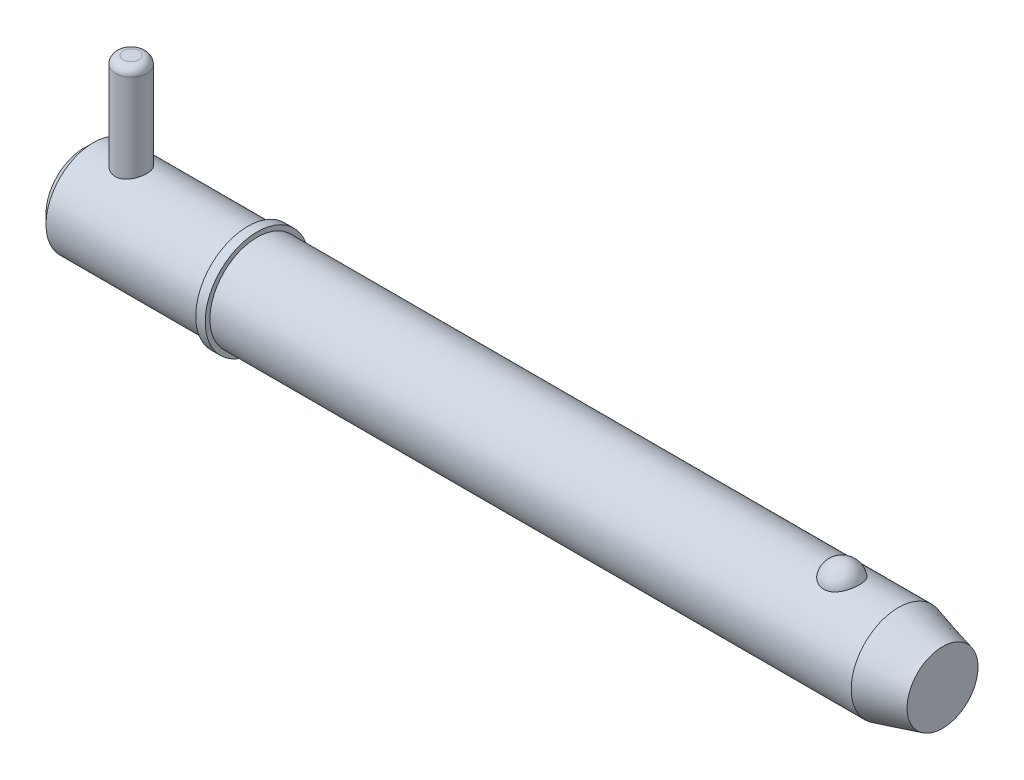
ISO-10303-21;
HEADER;
FILE_DESCRIPTION(('STEP AP214'),'2;1');
FILE_NAME('part.step','',(''),(''),'','','');
FILE_SCHEMA(('AUTOMOTIVE_DESIGN { 1 0 10303 214 1 1 1 1 }'));
ENDSEC;
DATA;
#1=APPLICATION_CONTEXT('core data for automotive mechanical design processes');
#2=APPLICATION_PROTOCOL_DEFINITION('international standard','automotive_design',2000,#1);
#3=PRODUCT_CONTEXT('',#1,'mechanical');
#4=PRODUCT('Part','Part','',(#3));
#5=PRODUCT_RELATED_PRODUCT_CATEGORY('part','',(#4));
#6=PRODUCT_DEFINITION_FORMATION('','',#4);
#7=PRODUCT_DEFINITION_CONTEXT('part definition',#1,'design');
#8=PRODUCT_DEFINITION('design','',#6,#7);
#9=PRODUCT_DEFINITION_SHAPE('','',#8);
#10=(LENGTH_UNIT() NAMED_UNIT(*) SI_UNIT(.MILLI.,.METRE.));
#11=(NAMED_UNIT(*) PLANE_ANGLE_UNIT() SI_UNIT($,.RADIAN.));
#12=(NAMED_UNIT(*) SI_UNIT($,.STERADIAN.) SOLID_ANGLE_UNIT());
#13=UNCERTAINTY_MEASURE_WITH_UNIT(LENGTH_MEASURE(1.E-05),#10,'distance_accuracy_value','');
#14=(GEOMETRIC_REPRESENTATION_CONTEXT(3) GLOBAL_UNCERTAINTY_ASSIGNED_CONTEXT((#13)) GLOBAL_UNIT_ASSIGNED_CONTEXT((#10,
#11,#12)) REPRESENTATION_CONTEXT('',''));
#15=CARTESIAN_POINT('',(0.,0.,0.));
#16=DIRECTION('',(0.,0.,1.));
#17=DIRECTION('',(1.,0.,0.));
#18=AXIS2_PLACEMENT_3D('',#15,#16,#17);
#19=CARTESIAN_POINT('',(9.52500000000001,28.575,0.));
#20=DIRECTION('',(0.,-1.,0.));
#21=DIRECTION('',(0.,0.,-1.));
#22=AXIS2_PLACEMENT_3D('',#19,#20,#21);
#23=CYLINDRICAL_SURFACE('',#22,3.175);
#24=CARTESIAN_POINT('',(9.52500000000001,-7.93750000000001,0.));
#25=DIRECTION('',(0.,1.,0.));
#26=DIRECTION('',(0.,0.,1.));
#27=AXIS2_PLACEMENT_3D('',#24,#25,#26);
#28=CIRCLE('',#27,3.175);
#29=CARTESIAN_POINT('',(9.52500000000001,-7.93750000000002,-3.175));
#30=VERTEX_POINT('',#29);
#31=EDGE_CURVE('P0_E25',#30,#30,#28,.T.);
#32=CARTESIAN_POINT('',(9.52500000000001,26.9875,0.));
#33=DIRECTION('',(0.,1.,0.));
#34=DIRECTION('',(0.,0.,1.));
#35=AXIS2_PLACEMENT_3D('',#32,#33,#34);
#36=CIRCLE('',#35,3.175);
#37=CARTESIAN_POINT('',(9.52500000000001,26.9875,-3.175));
#38=VERTEX_POINT('',#37);
#39=EDGE_CURVE('P0_E29',#38,#38,#36,.F.);
#40=CARTESIAN_POINT('',(9.52500000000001,-7.93750000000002,-3.175));
#41=CARTESIAN_POINT('',(9.52500000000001,-7.57369791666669,-3.175));
#42=CARTESIAN_POINT('',(9.52500000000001,-7.20989583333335,-3.175));
#43=CARTESIAN_POINT('',(9.52500000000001,-6.48229166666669,-3.175));
#44=CARTESIAN_POINT('',(9.52500000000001,-6.11848958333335,-3.175));
#45=CARTESIAN_POINT('',(9.52500000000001,-5.39088541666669,-3.175));
#46=CARTESIAN_POINT('',(9.52500000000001,-5.02708333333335,-3.175));
#47=CARTESIAN_POINT('',(9.52500000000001,-4.29947916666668,-3.175));
#48=CARTESIAN_POINT('',(9.52500000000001,-3.93567708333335,-3.175));
#49=CARTESIAN_POINT('',(9.52500000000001,-3.20807291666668,-3.175));
#50=CARTESIAN_POINT('',(9.52500000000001,-2.84427083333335,-3.175));
#51=CARTESIAN_POINT('',(9.52500000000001,-2.11666666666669,-3.175));
#52=CARTESIAN_POINT('',(9.52500000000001,-1.75286458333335,-3.175));
#53=CARTESIAN_POINT('',(9.52500000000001,-1.02526041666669,-3.175));
#54=CARTESIAN_POINT('',(9.52500000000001,-0.661458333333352,-3.175));
#55=CARTESIAN_POINT('',(9.52500000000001,0.0661458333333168,-3.175));
#56=CARTESIAN_POINT('',(9.52500000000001,0.429947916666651,-3.175));
#57=CARTESIAN_POINT('',(9.52500000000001,1.15755208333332,-3.175));
#58=CARTESIAN_POINT('',(9.52500000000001,1.52135416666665,-3.175));
#59=CARTESIAN_POINT('',(9.52500000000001,2.24895833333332,-3.175));
#60=CARTESIAN_POINT('',(9.52500000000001,2.61276041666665,-3.175));
#61=CARTESIAN_POINT('',(9.52500000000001,3.34036458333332,-3.175));
#62=CARTESIAN_POINT('',(9.52500000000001,3.70416666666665,-3.175));
#63=CARTESIAN_POINT('',(9.52500000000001,4.43177083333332,-3.175));
#64=CARTESIAN_POINT('',(9.52500000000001,4.79557291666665,-3.175));
#65=CARTESIAN_POINT('',(9.52500000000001,5.52317708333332,-3.175));
#66=CARTESIAN_POINT('',(9.52500000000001,5.88697916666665,-3.175));
#67=CARTESIAN_POINT('',(9.52500000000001,6.61458333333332,-3.175));
#68=CARTESIAN_POINT('',(9.52500000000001,6.97838541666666,-3.175));
#69=CARTESIAN_POINT('',(9.52500000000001,7.70598958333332,-3.175));
#70=CARTESIAN_POINT('',(9.52500000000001,8.06979166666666,-3.175));
#71=CARTESIAN_POINT('',(9.52500000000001,8.79739583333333,-3.175));
#72=CARTESIAN_POINT('',(9.52500000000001,9.16119791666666,-3.175));
#73=CARTESIAN_POINT('',(9.52500000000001,9.88880208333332,-3.175));
#74=CARTESIAN_POINT('',(9.52500000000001,10.2526041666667,-3.175));
#75=CARTESIAN_POINT('',(9.52500000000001,10.9802083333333,-3.175));
#76=CARTESIAN_POINT('',(9.52500000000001,11.3440104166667,-3.175));
#77=CARTESIAN_POINT('',(9.52500000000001,12.0716145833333,-3.175));
#78=CARTESIAN_POINT('',(9.52500000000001,12.4354166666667,-3.175));
#79=CARTESIAN_POINT('',(9.52500000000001,13.1630208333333,-3.175));
#80=CARTESIAN_POINT('',(9.52500000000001,13.5268229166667,-3.175));
#81=CARTESIAN_POINT('',(9.52500000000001,14.2544270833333,-3.175));
#82=CARTESIAN_POINT('',(9.52500000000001,14.6182291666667,-3.175));
#83=CARTESIAN_POINT('',(9.52500000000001,15.3458333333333,-3.175));
#84=CARTESIAN_POINT('',(9.52500000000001,15.7096354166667,-3.175));
#85=CARTESIAN_POINT('',(9.52500000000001,16.4372395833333,-3.175));
#86=CARTESIAN_POINT('',(9.52500000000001,16.8010416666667,-3.175));
#87=CARTESIAN_POINT('',(9.52500000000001,17.5286458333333,-3.175));
#88=CARTESIAN_POINT('',(9.52500000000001,17.8924479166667,-3.175));
#89=CARTESIAN_POINT('',(9.52500000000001,18.6200520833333,-3.175));
#90=CARTESIAN_POINT('',(9.52500000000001,18.9838541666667,-3.175));
#91=CARTESIAN_POINT('',(9.52500000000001,19.7114583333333,-3.175));
#92=CARTESIAN_POINT('',(9.52500000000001,20.0752604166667,-3.175));
#93=CARTESIAN_POINT('',(9.52500000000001,20.8028645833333,-3.175));
#94=CARTESIAN_POINT('',(9.52500000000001,21.1666666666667,-3.175));
#95=CARTESIAN_POINT('',(9.52500000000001,21.8942708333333,-3.175));
#96=CARTESIAN_POINT('',(9.52500000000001,22.2580729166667,-3.175));
#97=CARTESIAN_POINT('',(9.52500000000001,22.9856770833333,-3.175));
#98=CARTESIAN_POINT('',(9.52500000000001,23.3494791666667,-3.175));
#99=CARTESIAN_POINT('',(9.52500000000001,24.0770833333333,-3.175));
#100=CARTESIAN_POINT('',(9.52500000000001,24.4408854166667,-3.175));
#101=CARTESIAN_POINT('',(9.52500000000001,25.1684895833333,-3.175));
#102=CARTESIAN_POINT('',(9.52500000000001,25.5322916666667,-3.175));
#103=CARTESIAN_POINT('',(9.52500000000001,26.2598958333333,-3.175));
#104=CARTESIAN_POINT('',(9.52500000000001,26.6236979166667,-3.175));
#105=CARTESIAN_POINT('',(9.52500000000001,26.9875,-3.175));
#106=B_SPLINE_CURVE_WITH_KNOTS('',3,(#40,#41,#42,#43,#44,#45,#46,#47,#48,#49,#50,#51,#52,#53,
#54,#55,#56,#57,#58,#59,#60,#61,#62,#63,#64,#65,#66,#67,#68,#69,#70,#71,#72,#73,#74,#75,#76,#77,
#78,#79,#80,#81,#82,#83,#84,#85,#86,#87,#88,#89,#90,#91,#92,#93,#94,#95,#96,#97,#98,#99,#100,
#101,#102,#103,#104,#105),.UNSPECIFIED.,.F.,.F.,(4,2,2,2,2,2,2,2,2,2,2,2,2,2,2,2,2,2,2,2,2,2,2,
2,2,2,2,2,2,2,2,2,4),(0.,1.09140625,2.1828125,3.27421875,4.365625,5.45703125,6.5484375,
7.63984375,8.73125000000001,9.82265625,10.9140625,12.00546875,13.096875,14.18828125,15.2796875,
16.37109375,17.4625,18.55390625,19.6453125,20.73671875,21.828125,22.91953125,24.0109375,
25.10234375,26.19375,27.28515625,28.3765625,29.46796875,30.559375,31.65078125,32.7421875,
33.83359375,34.925),.UNSPECIFIED.);
#107=EDGE_CURVE('P0_BSEAM14',#30,#38,#106,.T.);
#108=ORIENTED_EDGE('',*,*,#31,.T.);
#109=ORIENTED_EDGE('',*,*,#39,.T.);
#110=ORIENTED_EDGE('',*,*,#107,.T.);
#111=ORIENTED_EDGE('',*,*,#107,.F.);
#112=EDGE_LOOP('',(#108,#110,#109,#111));
#113=FACE_BOUND('',#112,.T.);
#114=ADVANCED_FACE('P0_F14',(#113),#23,.T.);
#115=CARTESIAN_POINT('',(9.52500000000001,28.575,0.));
#116=DIRECTION('',(0.,1.,0.));
#117=DIRECTION('',(0.,0.,1.));
#118=AXIS2_PLACEMENT_3D('',#115,#116,#117);
#119=PLANE('',#118);
#120=CARTESIAN_POINT('',(9.52500000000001,28.575,0.));
#121=DIRECTION('',(0.,1.,0.));
#122=DIRECTION('',(0.,0.,1.));
#123=AXIS2_PLACEMENT_3D('',#120,#121,#122);
#124=CIRCLE('',#123,1.5875);
#125=CARTESIAN_POINT('',(9.52500000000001,28.575,1.5875));
#126=VERTEX_POINT('',#125);
#127=EDGE_CURVE('P0_E10',#126,#126,#124,.T.);
#128=ORIENTED_EDGE('',*,*,#127,.T.);
#129=EDGE_LOOP('',(#128));
#130=FACE_BOUND('',#129,.T.);
#131=ADVANCED_FACE('P0_F46',(#130),#119,.T.);
#132=CARTESIAN_POINT('',(9.52500000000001,-9.525,0.));
#133=DIRECTION('',(0.,1.,0.));
#134=DIRECTION('',(0.,0.,1.));
#135=AXIS2_PLACEMENT_3D('',#132,#133,#134);
#136=PLANE('',#135);
#137=CARTESIAN_POINT('',(9.52500000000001,-9.525,0.));
#138=DIRECTION('',(0.,1.,0.));
#139=DIRECTION('',(0.,0.,1.));
#140=AXIS2_PLACEMENT_3D('',#137,#138,#139);
#141=CIRCLE('',#140,1.5875);
#142=CARTESIAN_POINT('',(9.52500000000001,-9.525,1.5875));
#143=VERTEX_POINT('',#142);
#144=EDGE_CURVE('P0_E21',#143,#143,#141,.F.);
#145=ORIENTED_EDGE('',*,*,#144,.T.);
#146=EDGE_LOOP('',(#145));
#147=FACE_BOUND('',#146,.T.);
#148=ADVANCED_FACE('P0_F43',(#147),#136,.F.);
#149=CARTESIAN_POINT('',(9.52500000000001,-7.9375,0.));
#150=DIRECTION('',(0.,1.,0.));
#151=DIRECTION('',(0.,0.,1.));
#152=AXIS2_PLACEMENT_3D('',#149,#150,#151);
#153=DEGENERATE_TOROIDAL_SURFACE('',#152,1.5875,1.5875,.T.);
#154=ORIENTED_EDGE('',*,*,#144,.F.);
#155=EDGE_LOOP('',(#154));
#156=FACE_BOUND('',#155,.T.);
#157=ORIENTED_EDGE('',*,*,#31,.F.);
#158=EDGE_LOOP('',(#157));
#159=FACE_BOUND('',#158,.T.);
#160=ADVANCED_FACE('P0_F38',(#156,#159),#153,.T.);
#161=CARTESIAN_POINT('',(9.52500000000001,26.9875,0.));
#162=DIRECTION('',(0.,1.,0.));
#163=DIRECTION('',(0.,0.,1.));
#164=AXIS2_PLACEMENT_3D('',#161,#162,#163);
#165=DEGENERATE_TOROIDAL_SURFACE('',#164,1.5875,1.5875,.T.);
#166=ORIENTED_EDGE('',*,*,#39,.F.);
#167=EDGE_LOOP('',(#166));
#168=FACE_BOUND('',#167,.T.);
#169=ORIENTED_EDGE('',*,*,#127,.F.);
#170=EDGE_LOOP('',(#169));
#171=FACE_BOUND('',#170,.T.);
#172=ADVANCED_FACE('P0_F16',(#168,#171),#165,.T.);
#173=CLOSED_SHELL('',(#114,#131,#148,#160,#172));
#174=MANIFOLD_SOLID_BREP('P0_B1',#173);
#175=CARTESIAN_POINT('',(0.,0.,0.));
#176=DIRECTION('',(1.,0.,0.));
#177=DIRECTION('',(0.,0.,-1.));
#178=AXIS2_PLACEMENT_3D('',#175,#176,#177);
#179=CYLINDRICAL_SURFACE('',#178,9.525);
#180=CARTESIAN_POINT('',(164.143054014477,0.,0.));
#181=DIRECTION('',(1.,0.,0.));
#182=DIRECTION('',(0.,0.,-1.));
#183=AXIS2_PLACEMENT_3D('',#180,#181,#182);
#184=CIRCLE('',#183,9.525);
#185=CARTESIAN_POINT('',(164.143054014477,0.,-9.525));
#186=VERTEX_POINT('',#185);
#187=EDGE_CURVE('P1_E81',#186,#186,#184,.T.);
#188=ORIENTED_EDGE('',*,*,#187,.F.);
#189=EDGE_LOOP('',(#188));
#190=FACE_BOUND('',#189,.T.);
#191=CARTESIAN_POINT('',(34.93,0.,0.));
#192=DIRECTION('',(1.,0.,0.));
#193=DIRECTION('',(0.,0.,-1.));
#194=AXIS2_PLACEMENT_3D('',#191,#192,#193);
#195=CIRCLE('',#194,9.525);
#196=CARTESIAN_POINT('',(34.93,0.,-9.525));
#197=VERTEX_POINT('',#196);
#198=EDGE_CURVE('P1_E85',#197,#197,#195,.T.);
#199=ORIENTED_EDGE('',*,*,#198,.T.);
#200=EDGE_LOOP('',(#199));
#201=FACE_BOUND('',#200,.T.);
#202=CARTESIAN_POINT('',(152.745757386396,8.80405803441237,3.63513233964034));
#203=CARTESIAN_POINT('',(152.651676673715,8.80405953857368,3.63513053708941));
#204=CARTESIAN_POINT('',(152.557561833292,8.80561325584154,3.63137461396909));
#205=CARTESIAN_POINT('',(152.370012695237,8.81177748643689,3.61638665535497));
#206=CARTESIAN_POINT('',(152.276578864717,8.81638992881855,3.60514990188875));
#207=CARTESIAN_POINT('',(151.997945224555,8.83467114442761,3.56024627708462));
#208=CARTESIAN_POINT('',(151.814691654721,8.85278327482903,3.51538626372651));
#209=CARTESIAN_POINT('',(151.459509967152,8.89871214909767,3.39742145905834));
#210=CARTESIAN_POINT('',(151.287553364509,8.92650327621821,3.32439116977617));
#211=CARTESIAN_POINT('',(150.958707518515,8.98874819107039,3.15220244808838));
#212=CARTESIAN_POINT('',(150.801811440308,9.02319893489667,3.05305594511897));
#213=CARTESIAN_POINT('',(150.502214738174,9.09629186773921,2.82797815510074));
#214=CARTESIAN_POINT('',(150.360060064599,9.13502685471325,2.70135138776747));
#215=CARTESIAN_POINT('',(150.098299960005,9.21186572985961,2.42641932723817));
#216=CARTESIAN_POINT('',(149.978701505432,9.24996941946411,2.2781073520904));
#217=CARTESIAN_POINT('',(149.759645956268,9.32341082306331,1.95652290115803));
#218=CARTESIAN_POINT('',(149.661317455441,9.35855090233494,1.78243511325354));
#219=CARTESIAN_POINT('',(149.493819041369,9.42045142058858,1.41937246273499));
#220=CARTESIAN_POINT('',(149.424651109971,9.44721128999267,1.23039658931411));
#221=CARTESIAN_POINT('',(149.316199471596,9.48990641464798,0.840370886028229));
#222=CARTESIAN_POINT('',(149.277288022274,9.50570658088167,0.639202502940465));
#223=CARTESIAN_POINT('',(149.231555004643,9.52433146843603,0.232664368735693));
#224=CARTESIAN_POINT('',(149.224732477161,9.52715657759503,0.0272947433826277));
#225=CARTESIAN_POINT('',(149.243255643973,9.51956918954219,-0.380478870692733));
#226=CARTESIAN_POINT('',(149.268405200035,9.50923740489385,-0.582893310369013));
#227=CARTESIAN_POINT('',(149.35002537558,9.47651897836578,-0.98029399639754));
#228=CARTESIAN_POINT('',(149.406496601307,9.45413210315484,-1.17528009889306));
#229=CARTESIAN_POINT('',(149.549719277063,9.39954044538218,-1.55263697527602));
#230=CARTESIAN_POINT('',(149.636512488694,9.36732213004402,-1.73498993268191));
#231=CARTESIAN_POINT('',(149.838610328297,9.29640700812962,-2.08177763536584));
#232=CARTESIAN_POINT('',(149.953917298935,9.25770966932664,-2.24621090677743));
#233=CARTESIAN_POINT('',(150.211264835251,9.17775604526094,-2.5533833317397));
#234=CARTESIAN_POINT('',(150.353434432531,9.136488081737,-2.696011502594));
#235=CARTESIAN_POINT('',(150.66089985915,9.05620497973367,-2.95451229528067));
#236=CARTESIAN_POINT('',(150.826193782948,9.01718965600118,-3.07038711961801));
#237=CARTESIAN_POINT('',(151.172052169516,8.94680019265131,-3.26976836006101));
#238=CARTESIAN_POINT('',(151.352227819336,8.91528408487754,-3.35389750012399));
#239=CARTESIAN_POINT('',(151.725651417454,8.86272514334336,-3.49043503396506));
#240=CARTESIAN_POINT('',(151.918894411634,8.84167836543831,-3.54285537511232));
#241=CARTESIAN_POINT('',(152.302503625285,8.81348056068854,-3.61241306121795));
#242=CARTESIAN_POINT('',(152.492525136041,8.80568348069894,-3.6311933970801));
#243=CARTESIAN_POINT('',(152.873190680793,8.80289410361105,-3.63795342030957));
#244=CARTESIAN_POINT('',(153.063834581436,8.80789922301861,-3.62593932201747));
#245=CARTESIAN_POINT('',(153.434007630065,8.82974915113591,-3.57238430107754));
#246=CARTESIAN_POINT('',(153.613697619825,8.84621463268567,-3.53178890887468));
#247=CARTESIAN_POINT('',(153.963422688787,8.88875330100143,-3.42331083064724));
#248=CARTESIAN_POINT('',(154.133456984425,8.91482726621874,-3.35542593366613));
#249=CARTESIAN_POINT('',(154.463237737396,8.97448239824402,-3.19248225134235));
#250=CARTESIAN_POINT('',(154.622680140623,9.00821446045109,-3.0968647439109));
#251=CARTESIAN_POINT('',(154.923513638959,9.07935398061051,-2.88162736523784));
#252=CARTESIAN_POINT('',(155.064900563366,9.11676228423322,-2.76200196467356));
#253=CARTESIAN_POINT('',(155.33331931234,9.19347419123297,-2.49516285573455));
#254=CARTESIAN_POINT('',(155.459275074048,9.23277872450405,-2.34686614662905));
#255=CARTESIAN_POINT('',(155.685522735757,9.3073761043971,-2.03093683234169));
#256=CARTESIAN_POINT('',(155.78581004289,9.34266823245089,-1.86330077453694));
#257=CARTESIAN_POINT('',(155.961514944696,9.40674710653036,-1.50744893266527));
#258=CARTESIAN_POINT('',(156.036041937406,9.43529176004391,-1.31874876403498));
#259=CARTESIAN_POINT('',(156.15416505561,9.48144132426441,-0.930631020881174));
#260=CARTESIAN_POINT('',(156.197760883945,9.49904612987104,-0.731213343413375));
#261=CARTESIAN_POINT('',(156.253158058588,9.5215314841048,-0.327147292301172));
#262=CARTESIAN_POINT('',(156.264935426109,9.52640243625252,-0.122495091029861));
#263=CARTESIAN_POINT('',(156.256382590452,9.5228957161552,0.28601848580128));
#264=CARTESIAN_POINT('',(156.23605305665,9.5145183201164,0.489879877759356));
#265=CARTESIAN_POINT('',(156.163884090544,9.48544083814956,0.88999431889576));
#266=CARTESIAN_POINT('',(156.112199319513,9.46480124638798,1.08627971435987));
#267=CARTESIAN_POINT('',(155.978491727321,9.4133389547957,1.46682086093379));
#268=CARTESIAN_POINT('',(155.896466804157,9.38251554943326,1.65107577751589));
#269=CARTESIAN_POINT('',(155.70319292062,9.31365636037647,2.00346348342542));
#270=CARTESIAN_POINT('',(155.591783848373,9.27558138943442,2.17150083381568));
#271=CARTESIAN_POINT('',(155.342294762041,9.19638714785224,2.48563115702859));
#272=CARTESIAN_POINT('',(155.204216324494,9.15526805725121,2.63172542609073));
#273=CARTESIAN_POINT('',(154.904843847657,9.07465393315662,2.89750997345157));
#274=CARTESIAN_POINT('',(154.743610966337,9.03515496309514,3.01726776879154));
#275=CARTESIAN_POINT('',(154.401613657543,8.96227564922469,3.22732920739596));
#276=CARTESIAN_POINT('',(154.220841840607,8.92889763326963,3.31762165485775));
#277=CARTESIAN_POINT('',(153.851445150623,8.8734538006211,3.46314419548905));
#278=CARTESIAN_POINT('',(153.66332371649,8.85102983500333,3.51950082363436));
#279=CARTESIAN_POINT('',(153.37578699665,8.82666967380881,3.57993683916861));
#280=CARTESIAN_POINT('',(153.279133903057,8.82009725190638,3.59606217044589));
#281=CARTESIAN_POINT('',(153.084677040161,8.81020897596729,3.62022512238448));
#282=CARTESIAN_POINT('',(152.986874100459,8.80689090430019,3.62826825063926));
#283=CARTESIAN_POINT('',(152.841224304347,8.80445615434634,3.63416760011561));
#284=CARTESIAN_POINT('',(152.793495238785,8.80405727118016,3.63513325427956));
#285=CARTESIAN_POINT('',(152.745757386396,8.80405803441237,3.63513233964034));
#286=B_SPLINE_CURVE_WITH_KNOTS('',3,(#202,#203,#204,#205,#206,#207,#208,#209,#210,#211,#212,
#213,#214,#215,#216,#217,#218,#219,#220,#221,#222,#223,#224,#225,#226,#227,#228,#229,#230,#231,
#232,#233,#234,#235,#236,#237,#238,#239,#240,#241,#242,#243,#244,#245,#246,#247,#248,#249,#250,
#251,#252,#253,#254,#255,#256,#257,#258,#259,#260,#261,#262,#263,#264,#265,#266,#267,#268,#269,
#270,#271,#272,#273,#274,#275,#276,#277,#278,#279,#280,#281,#282,#283,#284,#285),.UNSPECIFIED.,
.T.,.F.,(4,2,2,2,2,2,2,2,2,2,2,2,2,2,2,2,2,2,2,2,2,2,2,2,2,2,2,2,2,2,2,2,2,2,2,2,2,2,2,2,2,4),
(0.,0.282202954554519,0.564584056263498,1.13017050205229,1.69427128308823,2.25811483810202,
2.83836627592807,3.41879688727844,4.02497117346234,4.63118665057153,5.24474754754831,
5.85829010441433,6.46808687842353,7.07789545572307,7.68854723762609,8.299249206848,
8.91296283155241,9.52662591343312,10.1275338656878,10.7282152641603,11.2986646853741,
11.8689989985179,12.4213015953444,12.973648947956,13.5380053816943,14.1024919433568,
14.695298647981,15.2882113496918,15.8999469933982,16.5116885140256,17.1238909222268,
17.7360805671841,18.3452748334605,18.9545113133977,19.567138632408,20.179729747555,
20.7907316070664,21.4019653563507,21.9915938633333,22.2859053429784,22.5800161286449,
22.7232098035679),.UNSPECIFIED.);
#287=CARTESIAN_POINT('',(152.745757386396,8.80405803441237,3.63513233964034));
#288=VERTEX_POINT('',#287);
#289=EDGE_CURVE('P1_E35',#288,#288,#286,.T.);
#290=ORIENTED_EDGE('',*,*,#289,.T.);
#291=EDGE_LOOP('',(#290));
#292=FACE_BOUND('',#291,.T.);
#293=ADVANCED_FACE('P1_F13',(#190,#201,#292),#179,.T.);
#294=CARTESIAN_POINT('',(0.,0.,0.));
#295=DIRECTION('',(-1.,0.,0.));
#296=DIRECTION('',(0.,0.,1.));
#297=AXIS2_PLACEMENT_3D('',#294,#295,#296);
#298=PLANE('',#297);
#299=CARTESIAN_POINT('',(0.,0.,0.));
#300=DIRECTION('',(1.,0.,0.));
#301=DIRECTION('',(0.,0.,-1.));
#302=AXIS2_PLACEMENT_3D('',#299,#300,#301);
#303=CIRCLE('',#302,7.62);
#304=CARTESIAN_POINT('',(0.,0.,-7.62));
#305=VERTEX_POINT('',#304);
#306=EDGE_CURVE('P1_E9',#305,#305,#303,.T.);
#307=ORIENTED_EDGE('',*,*,#306,.F.);
#308=EDGE_LOOP('',(#307));
#309=FACE_BOUND('',#308,.T.);
#310=ADVANCED_FACE('P1_F15',(#309),#298,.T.);
#311=CARTESIAN_POINT('',(1.90499999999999,0.,0.));
#312=DIRECTION('',(1.,0.,0.));
#313=DIRECTION('',(0.,0.,-1.));
#314=AXIS2_PLACEMENT_3D('',#311,#312,#313);
#315=CONICAL_SURFACE('',#314,9.525,0.785398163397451);
#316=ORIENTED_EDGE('',*,*,#306,.T.);
#317=EDGE_LOOP('',(#316));
#318=FACE_BOUND('',#317,.T.);
#319=CARTESIAN_POINT('',(1.90499999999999,0.,0.));
#320=DIRECTION('',(1.,0.,0.));
#321=DIRECTION('',(0.,0.,-1.));
#322=AXIS2_PLACEMENT_3D('',#319,#320,#321);
#323=CIRCLE('',#322,9.525);
#324=CARTESIAN_POINT('',(1.90499999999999,0.,-9.525));
#325=VERTEX_POINT('',#324);
#326=EDGE_CURVE('P1_E26',#325,#325,#323,.T.);
#327=ORIENTED_EDGE('',*,*,#326,.F.);
#328=EDGE_LOOP('',(#327));
#329=FACE_BOUND('',#328,.T.);
#330=ADVANCED_FACE('P1_F77',(#318,#329),#315,.T.);
#331=CARTESIAN_POINT('',(0.,0.,0.));
#332=DIRECTION('',(1.,0.,0.));
#333=DIRECTION('',(0.,0.,-1.));
#334=AXIS2_PLACEMENT_3D('',#331,#332,#333);
#335=CYLINDRICAL_SURFACE('',#334,9.525);
#336=CARTESIAN_POINT('',(9.525,-8.98025612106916,3.175));
#337=CARTESIAN_POINT('',(9.35206354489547,-8.98025555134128,3.17500081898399));
#338=CARTESIAN_POINT('',(9.17913201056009,-8.98530617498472,3.16082293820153));
#339=CARTESIAN_POINT('',(8.83839221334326,-9.00485797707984,3.10467734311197));
#340=CARTESIAN_POINT('',(8.67058479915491,-9.0193607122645,3.06270505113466));
#341=CARTESIAN_POINT('',(8.34508461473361,-9.05599546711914,2.95260866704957));
#342=CARTESIAN_POINT('',(8.18737272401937,-9.07811252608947,2.88453582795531));
#343=CARTESIAN_POINT('',(7.88555684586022,-9.12746212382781,2.72434567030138));
#344=CARTESIAN_POINT('',(7.74145587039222,-9.1546957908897,2.63222304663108));
#345=CARTESIAN_POINT('',(7.46531411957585,-9.21240503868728,2.42268738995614));
#346=CARTESIAN_POINT('',(7.33388351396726,-9.24296141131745,2.30449228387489));
#347=CARTESIAN_POINT('',(7.09229340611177,-9.30319020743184,2.0478358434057));
#348=CARTESIAN_POINT('',(6.98213731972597,-9.33286248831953,1.90937126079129));
#349=CARTESIAN_POINT('',(6.78345450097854,-9.38891527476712,1.61164431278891));
#350=CARTESIAN_POINT('',(6.69556709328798,-9.41518969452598,1.45193356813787));
#351=CARTESIAN_POINT('',(6.54814671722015,-9.46053437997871,1.11896913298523));
#352=CARTESIAN_POINT('',(6.48860610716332,-9.47960658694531,0.945719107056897));
#353=CARTESIAN_POINT('',(6.40163866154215,-9.50782564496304,0.596991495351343));
#354=CARTESIAN_POINT('',(6.373166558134,-9.5172947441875,0.421801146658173));
#355=CARTESIAN_POINT('',(6.3458207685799,-9.52638456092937,0.068890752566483));
#356=CARTESIAN_POINT('',(6.34693945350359,-9.52600781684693,-0.108828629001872));
#357=CARTESIAN_POINT('',(6.37808050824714,-9.51566675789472,-0.454353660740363));
#358=CARTESIAN_POINT('',(6.4069675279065,-9.50607905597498,-0.622274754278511));
#359=CARTESIAN_POINT('',(6.490947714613,-9.47886621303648,-0.950732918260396));
#360=CARTESIAN_POINT('',(6.54604265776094,-9.46124052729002,-1.11126948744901));
#361=CARTESIAN_POINT('',(6.68153768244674,-9.41945253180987,-1.42288410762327));
#362=CARTESIAN_POINT('',(6.76226085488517,-9.3952073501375,-1.57381010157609));
#363=CARTESIAN_POINT('',(6.94645456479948,-9.34270397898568,-1.86030973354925));
#364=CARTESIAN_POINT('',(7.04993142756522,-9.31444467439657,-1.99587908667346));
#365=CARTESIAN_POINT('',(7.28241619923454,-9.25532159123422,-2.2545702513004));
#366=CARTESIAN_POINT('',(7.4123967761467,-9.22439783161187,-2.37680549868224));
#367=CARTESIAN_POINT('',(7.69127470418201,-9.1645528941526,-2.5980302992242));
#368=CARTESIAN_POINT('',(7.84017496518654,-9.13563202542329,-2.6970162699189));
#369=CARTESIAN_POINT('',(8.15547526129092,-9.08273917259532,-2.87016016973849));
#370=CARTESIAN_POINT('',(8.32209451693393,-9.05884361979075,-2.94394402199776));
#371=CARTESIAN_POINT('',(8.66638917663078,-9.01959241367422,-3.06210713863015));
#372=CARTESIAN_POINT('',(8.84405991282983,-9.00423318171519,-3.10649872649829));
#373=CARTESIAN_POINT('',(9.19682677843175,-8.98460345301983,-3.16281207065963));
#374=CARTESIAN_POINT('',(9.37167742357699,-8.9798639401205,-3.17610837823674));
#375=CARTESIAN_POINT('',(9.72113927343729,-8.9806993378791,-3.17374726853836));
#376=CARTESIAN_POINT('',(9.89575051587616,-8.98627237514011,-3.15809511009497));
#377=CARTESIAN_POINT('',(10.2335233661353,-9.00663737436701,-3.09951644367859));
#378=CARTESIAN_POINT('',(10.3968722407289,-9.02110608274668,-3.05754530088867));
#379=CARTESIAN_POINT('',(10.7141759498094,-9.05727657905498,-2.94866651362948));
#380=CARTESIAN_POINT('',(10.8681291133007,-9.07897964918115,-2.88175444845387));
#381=CARTESIAN_POINT('',(11.1676828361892,-9.12802586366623,-2.72248103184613));
#382=CARTESIAN_POINT('',(11.3128635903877,-9.1555260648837,-2.62937980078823));
#383=CARTESIAN_POINT('',(11.5860387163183,-9.21276315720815,-2.42120937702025));
#384=CARTESIAN_POINT('',(11.7140280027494,-9.24250070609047,-2.30613370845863));
#385=CARTESIAN_POINT('',(11.9555513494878,-9.30259247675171,-2.05070616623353));
#386=CARTESIAN_POINT('',(12.0680936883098,-9.33290753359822,-1.90940458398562));
#387=CARTESIAN_POINT('',(12.267933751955,-9.3893275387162,-1.60917665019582));
#388=CARTESIAN_POINT('',(12.3552323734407,-9.41543263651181,-1.45025092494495));
#389=CARTESIAN_POINT('',(12.5013088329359,-9.46036988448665,-1.12007606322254));
#390=CARTESIAN_POINT('',(12.5602723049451,-9.47924920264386,-0.9489158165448));
#391=CARTESIAN_POINT('',(12.6483355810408,-9.50781089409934,-0.598355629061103));
#392=CARTESIAN_POINT('',(12.6774461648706,-9.5174965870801,-0.4189586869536));
#393=CARTESIAN_POINT('',(12.7040070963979,-9.52632915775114,-0.066088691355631));
#394=CARTESIAN_POINT('',(12.7028811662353,-9.52594996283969,0.107266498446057));
#395=CARTESIAN_POINT('',(12.6725130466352,-9.51586223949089,0.451202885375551));
#396=CARTESIAN_POINT('',(12.643273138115,-9.50615446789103,0.621784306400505));
#397=CARTESIAN_POINT('',(12.5584514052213,-9.47867404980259,0.952633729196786));
#398=CARTESIAN_POINT('',(12.5032953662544,-9.46103195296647,1.1130225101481));
#399=CARTESIAN_POINT('',(12.3686013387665,-9.41949985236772,1.42233126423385));
#400=CARTESIAN_POINT('',(12.2890589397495,-9.39560871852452,1.57124915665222));
#401=CARTESIAN_POINT('',(12.1044667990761,-9.34294133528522,1.85938800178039));
#402=CARTESIAN_POINT('',(11.9985831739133,-9.31401720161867,1.9980473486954));
#403=CARTESIAN_POINT('',(11.7657327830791,-9.25490239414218,2.25609475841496));
#404=CARTESIAN_POINT('',(11.6387592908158,-9.22471131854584,2.37547664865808));
#405=CARTESIAN_POINT('',(11.3613902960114,-9.16505913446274,2.59633024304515));
#406=CARTESIAN_POINT('',(11.2102725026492,-9.13567286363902,2.69691791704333));
#407=CARTESIAN_POINT('',(10.8923631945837,-9.08241113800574,2.87119803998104));
#408=CARTESIAN_POINT('',(10.7255757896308,-9.05853424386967,2.94489751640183));
#409=CARTESIAN_POINT('',(10.3887212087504,-9.02021736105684,3.06020415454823));
#410=CARTESIAN_POINT('',(10.219143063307,-9.00539959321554,3.10311136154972));
#411=CARTESIAN_POINT('',(9.87470703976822,-8.98542092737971,3.16050396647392));
#412=CARTESIAN_POINT('',(9.699851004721,-8.98025669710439,3.17499917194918));
#413=CARTESIAN_POINT('',(9.525,-8.98025612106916,3.175));
#414=B_SPLINE_CURVE_WITH_KNOTS('',3,(#336,#337,#338,#339,#340,#341,#342,#343,#344,#345,#346,
#347,#348,#349,#350,#351,#352,#353,#354,#355,#356,#357,#358,#359,#360,#361,#362,#363,#364,#365,
#366,#367,#368,#369,#370,#371,#372,#373,#374,#375,#376,#377,#378,#379,#380,#381,#382,#383,#384,
#385,#386,#387,#388,#389,#390,#391,#392,#393,#394,#395,#396,#397,#398,#399,#400,#401,#402,#403,
#404,#405,#406,#407,#408,#409,#410,#411,#412,#413),.UNSPECIFIED.,.T.,.F.,(4,2,2,2,2,2,2,2,2,2,2,
2,2,2,2,2,2,2,2,2,2,2,2,2,2,2,2,2,2,2,2,2,2,2,2,2,2,2,4),(0.,0.518161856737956,1.03640907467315,
1.55364379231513,2.07099270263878,2.60671746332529,3.14252816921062,3.69231882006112,
4.24196117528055,4.77247962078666,5.30286129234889,5.81244090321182,6.32205505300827,
6.83836754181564,7.3548237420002,7.89559553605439,8.43645060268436,8.98501631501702,
9.53335188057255,10.056948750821,10.5804505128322,11.0859695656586,11.5915782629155,
12.1132237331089,12.6350231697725,13.1819271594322,13.7288117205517,14.2720628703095,
14.815117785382,15.3326491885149,15.8501386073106,16.3594083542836,16.868770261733,
17.3969527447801,17.925304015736,18.4743376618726,19.023227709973,19.5473069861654,
20.0712053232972),.UNSPECIFIED.);
#415=CARTESIAN_POINT('',(9.525,-8.98025612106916,3.175));
#416=VERTEX_POINT('',#415);
#417=EDGE_CURVE('P1_E17',#416,#416,#414,.T.);
#418=ORIENTED_EDGE('',*,*,#417,.F.);
#419=EDGE_LOOP('',(#418));
#420=FACE_BOUND('',#419,.T.);
#421=CARTESIAN_POINT('',(9.525,8.98025612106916,3.175));
#422=CARTESIAN_POINT('',(9.69793645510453,8.98025555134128,3.17500081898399));
#423=CARTESIAN_POINT('',(9.87086798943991,8.98530617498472,3.16082293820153));
#424=CARTESIAN_POINT('',(10.2116077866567,9.00485797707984,3.10467734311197));
#425=CARTESIAN_POINT('',(10.3794152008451,9.0193607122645,3.06270505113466));
#426=CARTESIAN_POINT('',(10.7049153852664,9.05599546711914,2.95260866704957));
#427=CARTESIAN_POINT('',(10.8626272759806,9.07811252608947,2.88453582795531));
#428=CARTESIAN_POINT('',(11.1644431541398,9.12746212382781,2.72434567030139));
#429=CARTESIAN_POINT('',(11.3085441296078,9.15469579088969,2.63222304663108));
#430=CARTESIAN_POINT('',(11.5846858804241,9.21240503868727,2.42268738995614));
#431=CARTESIAN_POINT('',(11.7161164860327,9.24296141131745,2.30449228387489));
#432=CARTESIAN_POINT('',(11.9577065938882,9.30319020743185,2.0478358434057));
#433=CARTESIAN_POINT('',(12.067862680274,9.33286248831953,1.90937126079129));
#434=CARTESIAN_POINT('',(12.2665454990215,9.38891527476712,1.61164431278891));
#435=CARTESIAN_POINT('',(12.354432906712,9.41518969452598,1.45193356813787));
#436=CARTESIAN_POINT('',(12.5018532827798,9.46053437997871,1.11896913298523));
#437=CARTESIAN_POINT('',(12.5613938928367,9.47960658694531,0.945719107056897));
#438=CARTESIAN_POINT('',(12.6483613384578,9.50782564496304,0.596991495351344));
#439=CARTESIAN_POINT('',(12.676833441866,9.5172947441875,0.421801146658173));
#440=CARTESIAN_POINT('',(12.7041792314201,9.52638456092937,0.0688907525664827));
#441=CARTESIAN_POINT('',(12.7030605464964,9.52600781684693,-0.108828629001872));
#442=CARTESIAN_POINT('',(12.6719194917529,9.51566675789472,-0.454353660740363));
#443=CARTESIAN_POINT('',(12.6430324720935,9.50607905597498,-0.622274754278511));
#444=CARTESIAN_POINT('',(12.559052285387,9.47886621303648,-0.950732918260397));
#445=CARTESIAN_POINT('',(12.5039573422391,9.46124052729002,-1.11126948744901));
#446=CARTESIAN_POINT('',(12.3684623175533,9.41945253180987,-1.42288410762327));
#447=CARTESIAN_POINT('',(12.2877391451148,9.3952073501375,-1.57381010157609));
#448=CARTESIAN_POINT('',(12.1035454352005,9.34270397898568,-1.86030973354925));
#449=CARTESIAN_POINT('',(12.0000685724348,9.31444467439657,-1.99587908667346));
#450=CARTESIAN_POINT('',(11.7675838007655,9.25532159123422,-2.2545702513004));
#451=CARTESIAN_POINT('',(11.6376032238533,9.22439783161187,-2.37680549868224));
#452=CARTESIAN_POINT('',(11.358725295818,9.1645528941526,-2.5980302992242));
#453=CARTESIAN_POINT('',(11.2098250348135,9.13563202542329,-2.6970162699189));
#454=CARTESIAN_POINT('',(10.8945247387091,9.08273917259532,-2.87016016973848));
#455=CARTESIAN_POINT('',(10.7279054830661,9.05884361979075,-2.94394402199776));
#456=CARTESIAN_POINT('',(10.3836108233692,9.01959241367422,-3.06210713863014));
#457=CARTESIAN_POINT('',(10.2059400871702,9.00423318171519,-3.10649872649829));
#458=CARTESIAN_POINT('',(9.85317322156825,8.98460345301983,-3.16281207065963));
#459=CARTESIAN_POINT('',(9.67832257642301,8.9798639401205,-3.17610837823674));
#460=CARTESIAN_POINT('',(9.32886072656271,8.9806993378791,-3.17374726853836));
#461=CARTESIAN_POINT('',(9.15424948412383,8.98627237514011,-3.15809511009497));
#462=CARTESIAN_POINT('',(8.81647663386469,9.00663737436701,-3.09951644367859));
#463=CARTESIAN_POINT('',(8.65312775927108,9.02110608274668,-3.05754530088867));
#464=CARTESIAN_POINT('',(8.33582405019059,9.05727657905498,-2.94866651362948));
#465=CARTESIAN_POINT('',(8.18187088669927,9.07897964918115,-2.88175444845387));
#466=CARTESIAN_POINT('',(7.88231716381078,9.12802586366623,-2.72248103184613));
#467=CARTESIAN_POINT('',(7.73713640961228,9.1555260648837,-2.62937980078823));
#468=CARTESIAN_POINT('',(7.46396128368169,9.21276315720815,-2.42120937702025));
#469=CARTESIAN_POINT('',(7.33597199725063,9.24250070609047,-2.30613370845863));
#470=CARTESIAN_POINT('',(7.09444865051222,9.30259247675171,-2.05070616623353));
#471=CARTESIAN_POINT('',(6.98190631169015,9.33290753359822,-1.90940458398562));
#472=CARTESIAN_POINT('',(6.78206624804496,9.3893275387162,-1.60917665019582));
#473=CARTESIAN_POINT('',(6.6947676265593,9.41543263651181,-1.45025092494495));
#474=CARTESIAN_POINT('',(6.54869116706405,9.46036988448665,-1.12007606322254));
#475=CARTESIAN_POINT('',(6.48972769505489,9.47924920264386,-0.948915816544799));
#476=CARTESIAN_POINT('',(6.40166441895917,9.50781089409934,-0.598355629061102));
#477=CARTESIAN_POINT('',(6.3725538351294,9.5174965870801,-0.418958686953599));
#478=CARTESIAN_POINT('',(6.34599290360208,9.52632915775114,-0.0660886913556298));
#479=CARTESIAN_POINT('',(6.3471188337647,9.52594996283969,0.107266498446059));
#480=CARTESIAN_POINT('',(6.37748695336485,9.51586223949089,0.451202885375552));
#481=CARTESIAN_POINT('',(6.40672686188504,9.50615446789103,0.621784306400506));
#482=CARTESIAN_POINT('',(6.49154859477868,9.47867404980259,0.952633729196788));
#483=CARTESIAN_POINT('',(6.54670463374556,9.46103195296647,1.11302251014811));
#484=CARTESIAN_POINT('',(6.68139866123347,9.41949985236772,1.42233126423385));
#485=CARTESIAN_POINT('',(6.76094106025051,9.39560871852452,1.57124915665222));
#486=CARTESIAN_POINT('',(6.94553320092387,9.34294133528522,1.85938800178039));
#487=CARTESIAN_POINT('',(7.05141682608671,9.31401720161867,1.9980473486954));
#488=CARTESIAN_POINT('',(7.28426721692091,9.25490239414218,2.25609475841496));
#489=CARTESIAN_POINT('',(7.41124070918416,9.22471131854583,2.37547664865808));
#490=CARTESIAN_POINT('',(7.68860970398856,9.16505913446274,2.59633024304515));
#491=CARTESIAN_POINT('',(7.83972749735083,9.13567286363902,2.69691791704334));
#492=CARTESIAN_POINT('',(8.15763680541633,9.08241113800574,2.87119803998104));
#493=CARTESIAN_POINT('',(8.32442421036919,9.05853424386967,2.94489751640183));
#494=CARTESIAN_POINT('',(8.66127879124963,9.02021736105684,3.06020415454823));
#495=CARTESIAN_POINT('',(8.83085693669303,9.00539959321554,3.10311136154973));
#496=CARTESIAN_POINT('',(9.17529296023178,8.98542092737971,3.16050396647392));
#497=CARTESIAN_POINT('',(9.350148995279,8.98025669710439,3.17499917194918));
#498=CARTESIAN_POINT('',(9.525,8.98025612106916,3.175));
#499=B_SPLINE_CURVE_WITH_KNOTS('',3,(#421,#422,#423,#424,#425,#426,#427,#428,#429,#430,#431,
#432,#433,#434,#435,#436,#437,#438,#439,#440,#441,#442,#443,#444,#445,#446,#447,#448,#449,#450,
#451,#452,#453,#454,#455,#456,#457,#458,#459,#460,#461,#462,#463,#464,#465,#466,#467,#468,#469,
#470,#471,#472,#473,#474,#475,#476,#477,#478,#479,#480,#481,#482,#483,#484,#485,#486,#487,#488,
#489,#490,#491,#492,#493,#494,#495,#496,#497,#498),.UNSPECIFIED.,.T.,.F.,(4,2,2,2,2,2,2,2,2,2,2,
2,2,2,2,2,2,2,2,2,2,2,2,2,2,2,2,2,2,2,2,2,2,2,2,2,2,2,4),(0.,0.518161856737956,1.03640907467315,
1.55364379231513,2.07099270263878,2.60671746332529,3.14252816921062,3.69231882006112,
4.24196117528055,4.77247962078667,5.30286129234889,5.81244090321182,6.32205505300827,
6.83836754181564,7.3548237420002,7.89559553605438,8.43645060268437,8.98501631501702,
9.53335188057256,10.056948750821,10.5804505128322,11.0859695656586,11.5915782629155,
12.1132237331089,12.6350231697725,13.1819271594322,13.7288117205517,14.2720628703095,
14.815117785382,15.3326491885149,15.8501386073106,16.3594083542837,16.868770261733,
17.3969527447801,17.9253040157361,18.4743376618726,19.023227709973,19.5473069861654,
20.0712053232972),.UNSPECIFIED.);
#500=CARTESIAN_POINT('',(9.525,8.98025612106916,3.175));
#501=VERTEX_POINT('',#500);
#502=EDGE_CURVE('P1_E43',#501,#501,#499,.T.);
#503=ORIENTED_EDGE('',*,*,#502,.F.);
#504=EDGE_LOOP('',(#503));
#505=FACE_BOUND('',#504,.T.);
#506=ORIENTED_EDGE('',*,*,#326,.T.);
#507=EDGE_LOOP('',(#506));
#508=FACE_BOUND('',#507,.T.);
#509=CARTESIAN_POINT('',(33.025,0.,0.));
#510=DIRECTION('',(1.,0.,0.));
#511=DIRECTION('',(0.,0.,-1.));
#512=AXIS2_PLACEMENT_3D('',#509,#510,#511);
#513=CIRCLE('',#512,9.525);
#514=CARTESIAN_POINT('',(33.025,0.,-9.525));
#515=VERTEX_POINT('',#514);
#516=EDGE_CURVE('P1_E31',#515,#515,#513,.T.);
#517=ORIENTED_EDGE('',*,*,#516,.F.);
#518=EDGE_LOOP('',(#517));
#519=FACE_BOUND('',#518,.T.);
#520=ADVANCED_FACE('P1_F103',(#420,#505,#508,#519),#335,.T.);
#521=CARTESIAN_POINT('',(33.025,9.525,0.));
#522=DIRECTION('',(-1.,0.,0.));
#523=DIRECTION('',(0.,0.,1.));
#524=AXIS2_PLACEMENT_3D('',#521,#522,#523);
#525=PLANE('',#524);
#526=ORIENTED_EDGE('',*,*,#516,.T.);
#527=EDGE_LOOP('',(#526));
#528=FACE_BOUND('',#527,.T.);
#529=CARTESIAN_POINT('',(33.025,0.,0.));
#530=DIRECTION('',(1.,0.,0.));
#531=DIRECTION('',(0.,0.,-1.));
#532=AXIS2_PLACEMENT_3D('',#529,#530,#531);
#533=CIRCLE('',#532,10.4775);
#534=CARTESIAN_POINT('',(33.025,0.,-10.4775));
#535=VERTEX_POINT('',#534);
#536=EDGE_CURVE('P1_E91',#535,#535,#533,.T.);
#537=ORIENTED_EDGE('',*,*,#536,.F.);
#538=EDGE_LOOP('',(#537));
#539=FACE_BOUND('',#538,.T.);
#540=ADVANCED_FACE('P1_F100',(#528,#539),#525,.T.);
#541=CARTESIAN_POINT('',(0.,0.,0.));
#542=DIRECTION('',(1.,0.,0.));
#543=DIRECTION('',(0.,0.,-1.));
#544=AXIS2_PLACEMENT_3D('',#541,#542,#543);
#545=CYLINDRICAL_SURFACE('',#544,10.4775);
#546=ORIENTED_EDGE('',*,*,#536,.T.);
#547=EDGE_LOOP('',(#546));
#548=FACE_BOUND('',#547,.T.);
#549=CARTESIAN_POINT('',(34.93,0.,0.));
#550=DIRECTION('',(1.,0.,0.));
#551=DIRECTION('',(0.,0.,-1.));
#552=AXIS2_PLACEMENT_3D('',#549,#550,#551);
#553=CIRCLE('',#552,10.4775);
#554=CARTESIAN_POINT('',(34.93,0.,-10.4775));
#555=VERTEX_POINT('',#554);
#556=EDGE_CURVE('P1_E88',#555,#555,#553,.T.);
#557=ORIENTED_EDGE('',*,*,#556,.F.);
#558=EDGE_LOOP('',(#557));
#559=FACE_BOUND('',#558,.T.);
#560=ADVANCED_FACE('P1_F68',(#548,#559),#545,.T.);
#561=CARTESIAN_POINT('',(34.93,10.4775,0.));
#562=DIRECTION('',(1.,0.,0.));
#563=DIRECTION('',(0.,0.,-1.));
#564=AXIS2_PLACEMENT_3D('',#561,#562,#563);
#565=PLANE('',#564);
#566=ORIENTED_EDGE('',*,*,#556,.T.);
#567=EDGE_LOOP('',(#566));
#568=FACE_BOUND('',#567,.T.);
#569=ORIENTED_EDGE('',*,*,#198,.F.);
#570=EDGE_LOOP('',(#569));
#571=FACE_BOUND('',#570,.T.);
#572=ADVANCED_FACE('P1_F62',(#568,#571),#565,.T.);
#573=CARTESIAN_POINT('',(173.03,0.,0.));
#574=DIRECTION('',(-1.,0.,0.));
#575=DIRECTION('',(0.,0.,1.));
#576=AXIS2_PLACEMENT_3D('',#573,#574,#575);
#577=CONICAL_SURFACE('',#576,7.14375000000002,0.261799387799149);
#578=ORIENTED_EDGE('',*,*,#187,.T.);
#579=EDGE_LOOP('',(#578));
#580=FACE_BOUND('',#579,.T.);
#581=CARTESIAN_POINT('',(173.03,0.,0.));
#582=DIRECTION('',(1.,0.,0.));
#583=DIRECTION('',(0.,0.,-1.));
#584=AXIS2_PLACEMENT_3D('',#581,#582,#583);
#585=CIRCLE('',#584,7.14375000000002);
#586=CARTESIAN_POINT('',(173.03,0.,-7.14375000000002));
#587=VERTEX_POINT('',#586);
#588=EDGE_CURVE('P1_E42',#587,#587,#585,.T.);
#589=ORIENTED_EDGE('',*,*,#588,.F.);
#590=EDGE_LOOP('',(#589));
#591=FACE_BOUND('',#590,.T.);
#592=ADVANCED_FACE('P1_F59',(#580,#591),#577,.T.);
#593=CARTESIAN_POINT('',(173.03,7.14375000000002,0.));
#594=DIRECTION('',(1.,0.,0.));
#595=DIRECTION('',(0.,0.,-1.));
#596=AXIS2_PLACEMENT_3D('',#593,#594,#595);
#597=PLANE('',#596);
#598=ORIENTED_EDGE('',*,*,#588,.T.);
#599=EDGE_LOOP('',(#598));
#600=FACE_BOUND('',#599,.T.);
#601=ADVANCED_FACE('P1_F55',(#600),#597,.T.);
#602=CARTESIAN_POINT('',(152.745757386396,8.5725,0.));
#603=DIRECTION('',(-1.,0.,0.));
#604=DIRECTION('',(0.,1.,0.));
#605=AXIS2_PLACEMENT_3D('',#602,#603,#604);
#606=SPHERICAL_SURFACE('',#605,3.64249999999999);
#607=ORIENTED_EDGE('',*,*,#289,.F.);
#608=EDGE_LOOP('',(#607));
#609=FACE_BOUND('',#608,.T.);
#610=ADVANCED_FACE('P1_F50',(#609),#606,.T.);
#611=CARTESIAN_POINT('',(9.525,-10.4775,0.));
#612=DIRECTION('',(0.,1.,0.));
#613=DIRECTION('',(0.,0.,1.));
#614=AXIS2_PLACEMENT_3D('',#611,#612,#613);
#615=CYLINDRICAL_SURFACE('',#614,3.175);
#616=ORIENTED_EDGE('',*,*,#417,.T.);
#617=EDGE_LOOP('',(#616));
#618=FACE_BOUND('',#617,.T.);
#619=ORIENTED_EDGE('',*,*,#502,.T.);
#620=EDGE_LOOP('',(#619));
#621=FACE_BOUND('',#620,.T.);
#622=ADVANCED_FACE('P1_F54',(#618,#621),#615,.F.);
#623=CLOSED_SHELL('',(#293,#310,#330,#520,#540,#560,#572,#592,#601,#610,#622));
#624=MANIFOLD_SOLID_BREP('P1_B1',#623);
#625=ADVANCED_BREP_SHAPE_REPRESENTATION('',(#18,#174,#624),#14);
#626=SHAPE_DEFINITION_REPRESENTATION(#9,#625);
ENDSEC;
END-ISO-10303-21;
